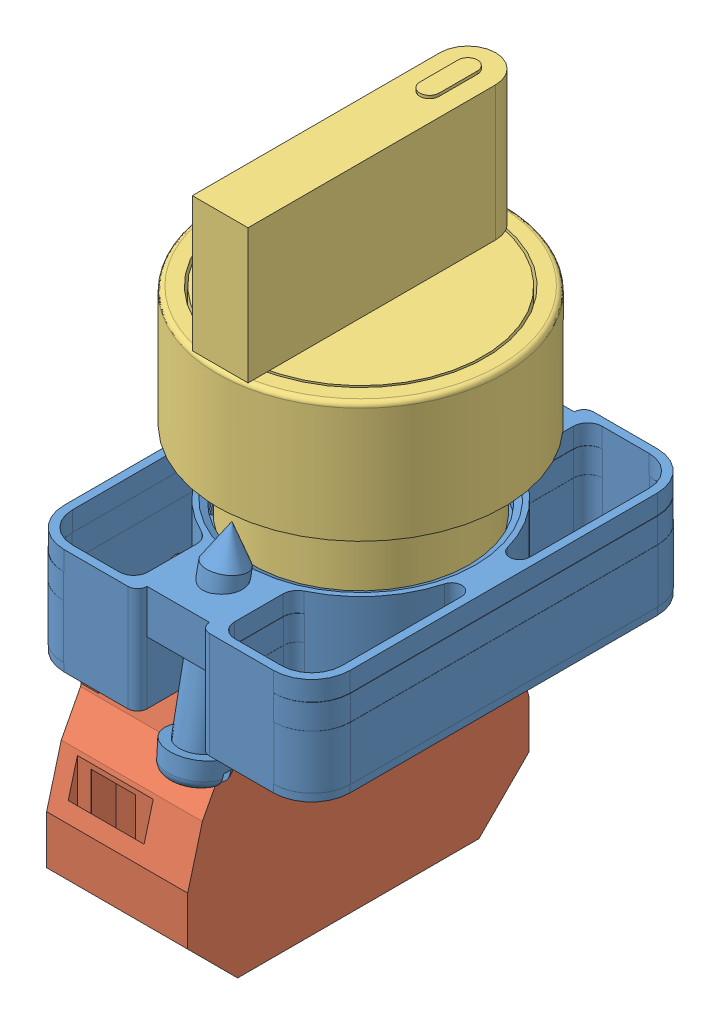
SolidWorks assembly gcx3300.SLDASM, configuration Default (file format 8000). Lengths in mm.
Overall size (29.91 70.6 40.16).
3 component instances, 3 part files, 0 mates.
Components (placement in the parent):
- gcx3300_01-1: gcx3300_01.SLDPRT [Default] at origin size (29.91 21.19 40.16)
- gcx3300_02-1: gcx3300_02.SLDPRT [Default] at origin size (14.7 32 35.54)
- gcx3300_03-1: gcx3300_03.SLDPRT [Default] at origin size (29.85 41.5 29.85)
